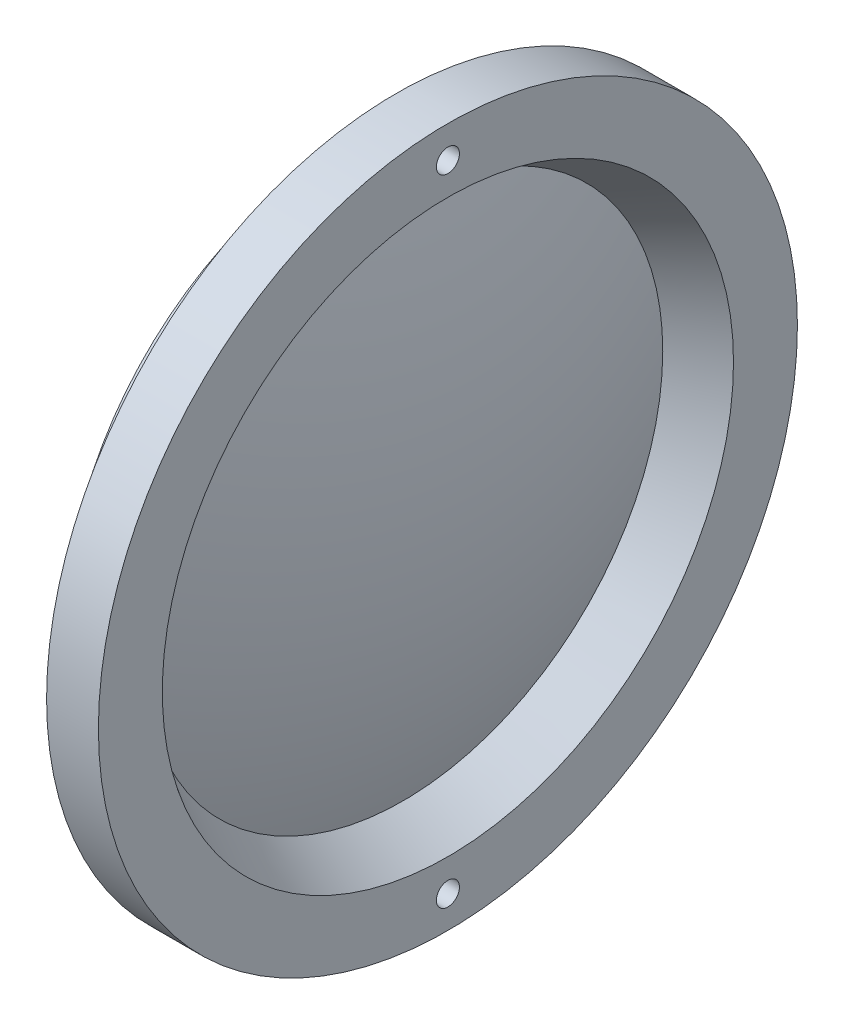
ISO-10303-21;
HEADER;
FILE_DESCRIPTION(('STEP AP214'),'2;1');
FILE_NAME('part.step','',(''),(''),'','','');
FILE_SCHEMA(('AUTOMOTIVE_DESIGN { 1 0 10303 214 1 1 1 1 }'));
ENDSEC;
DATA;
#1=APPLICATION_CONTEXT('core data for automotive mechanical design processes');
#2=APPLICATION_PROTOCOL_DEFINITION('international standard','automotive_design',2000,#1);
#3=PRODUCT_CONTEXT('',#1,'mechanical');
#4=PRODUCT('Part','Part','',(#3));
#5=PRODUCT_RELATED_PRODUCT_CATEGORY('part','',(#4));
#6=PRODUCT_DEFINITION_FORMATION('','',#4);
#7=PRODUCT_DEFINITION_CONTEXT('part definition',#1,'design');
#8=PRODUCT_DEFINITION('design','',#6,#7);
#9=PRODUCT_DEFINITION_SHAPE('','',#8);
#10=(LENGTH_UNIT() NAMED_UNIT(*) SI_UNIT(.MILLI.,.METRE.));
#11=(NAMED_UNIT(*) PLANE_ANGLE_UNIT() SI_UNIT($,.RADIAN.));
#12=(NAMED_UNIT(*) SI_UNIT($,.STERADIAN.) SOLID_ANGLE_UNIT());
#13=UNCERTAINTY_MEASURE_WITH_UNIT(LENGTH_MEASURE(1.E-05),#10,'distance_accuracy_value','');
#14=(GEOMETRIC_REPRESENTATION_CONTEXT(3) GLOBAL_UNCERTAINTY_ASSIGNED_CONTEXT((#13)) GLOBAL_UNIT_ASSIGNED_CONTEXT((#10,
#11,#12)) REPRESENTATION_CONTEXT('',''));
#15=CARTESIAN_POINT('',(0.,0.,0.));
#16=DIRECTION('',(0.,0.,1.));
#17=DIRECTION('',(1.,0.,0.));
#18=AXIS2_PLACEMENT_3D('',#15,#16,#17);
#19=CARTESIAN_POINT('',(-71.5000000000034,0.,0.));
#20=DIRECTION('',(-1.,0.,0.));
#21=DIRECTION('',(0.,1.,0.));
#22=AXIS2_PLACEMENT_3D('',#19,#20,#21);
#23=SPHERICAL_SURFACE('',#22,72.5000000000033);
#24=CARTESIAN_POINT('',(0.,0.,0.));
#25=DIRECTION('',(-1.,0.,0.));
#26=DIRECTION('',(0.,0.,1.));
#27=AXIS2_PLACEMENT_3D('',#24,#25,#26);
#28=CIRCLE('',#27,12.);
#29=CARTESIAN_POINT('',(0.,0.,12.));
#30=VERTEX_POINT('',#29);
#31=EDGE_CURVE('E10',#30,#30,#28,.T.);
#32=ORIENTED_EDGE('',*,*,#31,.T.);
#33=EDGE_LOOP('',(#32));
#34=FACE_BOUND('',#33,.T.);
#35=ADVANCED_FACE('F41',(#34),#23,.F.);
#36=CARTESIAN_POINT('',(-7.21529701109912,0.,0.));
#37=DIRECTION('',(-1.,0.,0.));
#38=DIRECTION('',(0.,0.,1.));
#39=AXIS2_PLACEMENT_3D('',#36,#37,#38);
#40=CYLINDRICAL_SURFACE('',#39,12.);
#41=CARTESIAN_POINT('',(2.35,0.,0.));
#42=DIRECTION('',(1.,0.,0.));
#43=DIRECTION('',(0.,0.,-1.));
#44=AXIS2_PLACEMENT_3D('',#41,#42,#43);
#45=CIRCLE('',#44,12.);
#46=CARTESIAN_POINT('',(2.35,0.,-12.));
#47=VERTEX_POINT('',#46);
#48=EDGE_CURVE('E68',#47,#47,#45,.T.);
#49=ORIENTED_EDGE('',*,*,#48,.F.);
#50=EDGE_LOOP('',(#49));
#51=FACE_BOUND('',#50,.T.);
#52=ORIENTED_EDGE('',*,*,#31,.F.);
#53=EDGE_LOOP('',(#52));
#54=FACE_BOUND('',#53,.T.);
#55=ADVANCED_FACE('F128',(#51,#54),#40,.T.);
#56=CARTESIAN_POINT('',(2.35,12.,0.));
#57=DIRECTION('',(-1.,0.,0.));
#58=DIRECTION('',(0.,0.,1.));
#59=AXIS2_PLACEMENT_3D('',#56,#57,#58);
#60=PLANE('',#59);
#61=ORIENTED_EDGE('',*,*,#48,.T.);
#62=EDGE_LOOP('',(#61));
#63=FACE_BOUND('',#62,.T.);
#64=CARTESIAN_POINT('',(2.35,0.,0.));
#65=DIRECTION('',(1.,0.,0.));
#66=DIRECTION('',(0.,0.,-1.));
#67=AXIS2_PLACEMENT_3D('',#64,#65,#66);
#68=CIRCLE('',#67,15.175);
#69=CARTESIAN_POINT('',(2.35,0.,-15.175));
#70=VERTEX_POINT('',#69);
#71=EDGE_CURVE('E48',#70,#70,#68,.T.);
#72=ORIENTED_EDGE('',*,*,#71,.F.);
#73=EDGE_LOOP('',(#72));
#74=FACE_BOUND('',#73,.T.);
#75=ADVANCED_FACE('F133',(#63,#74),#60,.T.);
#76=CARTESIAN_POINT('',(0.,0.,0.));
#77=DIRECTION('',(1.,0.,0.));
#78=DIRECTION('',(0.,0.,-1.));
#79=AXIS2_PLACEMENT_3D('',#76,#77,#78);
#80=CYLINDRICAL_SURFACE('',#79,15.175);
#81=ORIENTED_EDGE('',*,*,#71,.T.);
#82=EDGE_LOOP('',(#81));
#83=FACE_BOUND('',#82,.T.);
#84=CARTESIAN_POINT('',(4.6,0.,0.));
#85=DIRECTION('',(1.,0.,0.));
#86=DIRECTION('',(0.,0.,-1.));
#87=AXIS2_PLACEMENT_3D('',#84,#85,#86);
#88=CIRCLE('',#87,15.175);
#89=CARTESIAN_POINT('',(4.6,0.,-15.175));
#90=VERTEX_POINT('',#89);
#91=EDGE_CURVE('E53',#90,#90,#88,.T.);
#92=ORIENTED_EDGE('',*,*,#91,.F.);
#93=EDGE_LOOP('',(#92));
#94=FACE_BOUND('',#93,.T.);
#95=ADVANCED_FACE('F102',(#83,#94),#80,.T.);
#96=CARTESIAN_POINT('',(4.6,15.175,0.));
#97=DIRECTION('',(1.,0.,0.));
#98=DIRECTION('',(0.,0.,-1.));
#99=AXIS2_PLACEMENT_3D('',#96,#97,#98);
#100=PLANE('',#99);
#101=CARTESIAN_POINT('',(4.6,-13.7870802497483,0.));
#102=DIRECTION('',(1.,0.,0.));
#103=DIRECTION('',(0.,0.,-1.));
#104=AXIS2_PLACEMENT_3D('',#101,#102,#103);
#105=CIRCLE('',#104,0.5);
#106=CARTESIAN_POINT('',(4.6,-13.7870802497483,-0.5));
#107=VERTEX_POINT('',#106);
#108=EDGE_CURVE('E81',#107,#107,#105,.T.);
#109=ORIENTED_EDGE('',*,*,#108,.F.);
#110=EDGE_LOOP('',(#109));
#111=FACE_BOUND('',#110,.T.);
#112=CARTESIAN_POINT('',(4.6,13.7870802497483,0.));
#113=DIRECTION('',(1.,0.,0.));
#114=DIRECTION('',(0.,0.,-1.));
#115=AXIS2_PLACEMENT_3D('',#112,#113,#114);
#116=CIRCLE('',#115,0.5);
#117=CARTESIAN_POINT('',(4.6,13.7870802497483,-0.5));
#118=VERTEX_POINT('',#117);
#119=EDGE_CURVE('E73',#118,#118,#116,.T.);
#120=ORIENTED_EDGE('',*,*,#119,.F.);
#121=EDGE_LOOP('',(#120));
#122=FACE_BOUND('',#121,.T.);
#123=ORIENTED_EDGE('',*,*,#91,.T.);
#124=EDGE_LOOP('',(#123));
#125=FACE_BOUND('',#124,.T.);
#126=CARTESIAN_POINT('',(4.6,0.,0.));
#127=DIRECTION('',(1.,0.,0.));
#128=DIRECTION('',(0.,0.,-1.));
#129=AXIS2_PLACEMENT_3D('',#126,#127,#128);
#130=CIRCLE('',#129,12.3991604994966);
#131=CARTESIAN_POINT('',(4.6,0.,-12.3991604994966));
#132=VERTEX_POINT('',#131);
#133=EDGE_CURVE('E58',#132,#132,#130,.T.);
#134=ORIENTED_EDGE('',*,*,#133,.F.);
#135=EDGE_LOOP('',(#134));
#136=FACE_BOUND('',#135,.T.);
#137=ADVANCED_FACE('F98',(#111,#122,#125,#136),#100,.T.);
#138=CARTESIAN_POINT('',(2.65289689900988,0.,0.));
#139=DIRECTION('',(1.,0.,0.));
#140=DIRECTION('',(0.,0.,-1.));
#141=AXIS2_PLACEMENT_3D('',#138,#139,#140);
#142=CONICAL_SURFACE('',#141,11.275,0.523598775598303);
#143=ORIENTED_EDGE('',*,*,#133,.T.);
#144=EDGE_LOOP('',(#143));
#145=FACE_BOUND('',#144,.T.);
#146=CARTESIAN_POINT('',(2.65289689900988,0.,0.));
#147=DIRECTION('',(1.,0.,0.));
#148=DIRECTION('',(0.,0.,-1.));
#149=AXIS2_PLACEMENT_3D('',#146,#147,#148);
#150=CIRCLE('',#149,11.275);
#151=CARTESIAN_POINT('',(2.65289689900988,0.,-11.275));
#152=VERTEX_POINT('',#151);
#153=EDGE_CURVE('E64',#152,#152,#150,.T.);
#154=ORIENTED_EDGE('',*,*,#153,.F.);
#155=EDGE_LOOP('',(#154));
#156=FACE_BOUND('',#155,.T.);
#157=ADVANCED_FACE('F101',(#145,#156),#142,.F.);
#158=CARTESIAN_POINT('',(-30.8357142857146,0.,0.));
#159=DIRECTION('',(-1.,0.,0.));
#160=DIRECTION('',(0.,1.,0.));
#161=AXIS2_PLACEMENT_3D('',#158,#159,#160);
#162=SPHERICAL_SURFACE('',#161,35.3357142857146);
#163=ORIENTED_EDGE('',*,*,#153,.T.);
#164=EDGE_LOOP('',(#163));
#165=FACE_BOUND('',#164,.T.);
#166=ADVANCED_FACE('F112',(#165),#162,.T.);
#167=CARTESIAN_POINT('',(3.6,13.7870802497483,0.));
#168=DIRECTION('',(1.,0.,0.));
#169=DIRECTION('',(0.,0.,-1.));
#170=AXIS2_PLACEMENT_3D('',#167,#168,#169);
#171=CYLINDRICAL_SURFACE('',#170,0.5);
#172=CARTESIAN_POINT('',(3.6,13.7870802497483,0.));
#173=DIRECTION('',(1.,0.,0.));
#174=DIRECTION('',(0.,0.,-1.));
#175=AXIS2_PLACEMENT_3D('',#172,#173,#174);
#176=CIRCLE('',#175,0.5);
#177=CARTESIAN_POINT('',(3.6,13.7870802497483,-0.5));
#178=VERTEX_POINT('',#177);
#179=EDGE_CURVE('E77',#178,#178,#176,.T.);
#180=ORIENTED_EDGE('',*,*,#179,.F.);
#181=EDGE_LOOP('',(#180));
#182=FACE_BOUND('',#181,.T.);
#183=ORIENTED_EDGE('',*,*,#119,.T.);
#184=EDGE_LOOP('',(#183));
#185=FACE_BOUND('',#184,.T.);
#186=ADVANCED_FACE('F117',(#182,#185),#171,.F.);
#187=CARTESIAN_POINT('',(3.6,13.7870802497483,0.));
#188=DIRECTION('',(1.,0.,0.));
#189=DIRECTION('',(0.,0.,-1.));
#190=AXIS2_PLACEMENT_3D('',#187,#188,#189);
#191=PLANE('',#190);
#192=ORIENTED_EDGE('',*,*,#179,.T.);
#193=EDGE_LOOP('',(#192));
#194=FACE_BOUND('',#193,.T.);
#195=ADVANCED_FACE('F94',(#194),#191,.T.);
#196=CARTESIAN_POINT('',(3.6,-13.7870802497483,0.));
#197=DIRECTION('',(1.,0.,0.));
#198=DIRECTION('',(0.,0.,-1.));
#199=AXIS2_PLACEMENT_3D('',#196,#197,#198);
#200=CYLINDRICAL_SURFACE('',#199,0.5);
#201=CARTESIAN_POINT('',(3.6,-13.7870802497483,0.));
#202=DIRECTION('',(1.,0.,0.));
#203=DIRECTION('',(0.,0.,-1.));
#204=AXIS2_PLACEMENT_3D('',#201,#202,#203);
#205=CIRCLE('',#204,0.5);
#206=CARTESIAN_POINT('',(3.6,-13.7870802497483,-0.5));
#207=VERTEX_POINT('',#206);
#208=EDGE_CURVE('E72',#207,#207,#205,.T.);
#209=ORIENTED_EDGE('',*,*,#208,.F.);
#210=EDGE_LOOP('',(#209));
#211=FACE_BOUND('',#210,.T.);
#212=ORIENTED_EDGE('',*,*,#108,.T.);
#213=EDGE_LOOP('',(#212));
#214=FACE_BOUND('',#213,.T.);
#215=ADVANCED_FACE('F91',(#211,#214),#200,.F.);
#216=CARTESIAN_POINT('',(3.6,-13.7870802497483,0.));
#217=DIRECTION('',(1.,0.,0.));
#218=DIRECTION('',(0.,0.,-1.));
#219=AXIS2_PLACEMENT_3D('',#216,#217,#218);
#220=PLANE('',#219);
#221=ORIENTED_EDGE('',*,*,#208,.T.);
#222=EDGE_LOOP('',(#221));
#223=FACE_BOUND('',#222,.T.);
#224=ADVANCED_FACE('F89',(#223),#220,.T.);
#225=CLOSED_SHELL('',(#35,#55,#75,#95,#137,#157,#166,#186,#195,#215,#224));
#226=MANIFOLD_SOLID_BREP('B2',#225);
#227=ADVANCED_BREP_SHAPE_REPRESENTATION('',(#18,#226),#14);
#228=SHAPE_DEFINITION_REPRESENTATION(#9,#227);
ENDSEC;
END-ISO-10303-21;
